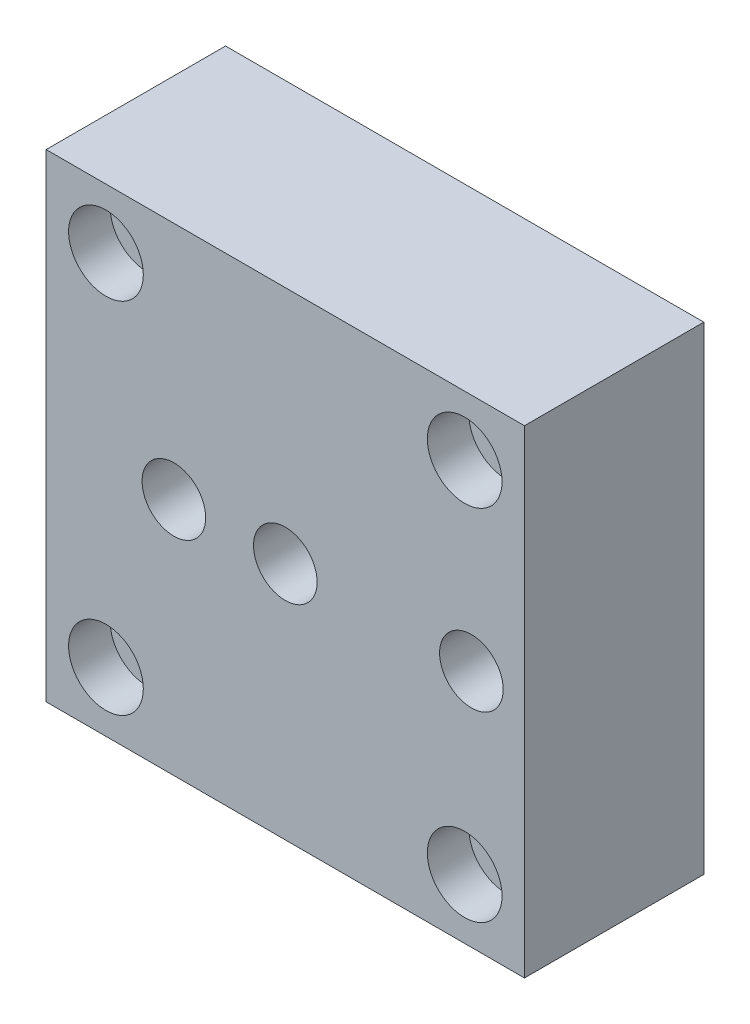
from build123d import *

# Parameters (mm, degrees)
SKETCH1_W                                           = 50.8
SKETCH1_H                                           = 50.8
BOSS_EXTRUDE1_DEPTH                                 = 19.05
CBORE_FOR_8_BINDING_HEAD_MACHINE_SCREW1_D           = 4.3053
CBORE_FOR_8_BINDING_HEAD_MACHINE_SCREW1_CBORE_D     = 7.9375
CBORE_FOR_8_BINDING_HEAD_MACHINE_SCREW1_CBORE_DEPTH = 4.4196
SKETCH5_R                                           = 3.3782
CUT_EXTRUDE1_DEPTH                                  = 41.659838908
SKETCH6_R                                           = 3.3782
CUT_EXTRUDE2_DEPTH                                  = 41.659838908


with BuildPart() as part:
    # Sketch1 → Boss-Extrude1 (new body)
    with BuildSketch(Plane.XY):
        Rectangle(SKETCH1_W, SKETCH1_H)
    extrude(amount=BOSS_EXTRUDE1_DEPTH)

    # CBORE for _8 Binding Head Machine Screw1 (through all)
    with Locations(Plane.XY.offset(19.05)):
        with Locations((-19.05, 19.05), (19.05, 19.05), (-19.05, -19.05), (19.05, -19.05)):
            CounterBoreHole(CBORE_FOR_8_BINDING_HEAD_MACHINE_SCREW1_D / 2, CBORE_FOR_8_BINDING_HEAD_MACHINE_SCREW1_CBORE_D / 2, CBORE_FOR_8_BINDING_HEAD_MACHINE_SCREW1_CBORE_DEPTH)

    # Sketch5 → Cut-Extrude1 (cut, through all)
    with BuildSketch(Plane.XY.offset(19.05)):
        Circle(SKETCH5_R)
    extrude(amount=-CUT_EXTRUDE1_DEPTH, mode=Mode.SUBTRACT)

    # Sketch6 → Cut-Extrude2 (cut, through all)
    with BuildSketch(Plane.XY.offset(19.05)):
        with Locations((19.7612, 0)):
            Circle(SKETCH6_R)
        with Locations((-11.8364, 0)):
            Circle(SKETCH6_R)
    extrude(amount=-CUT_EXTRUDE2_DEPTH, mode=Mode.SUBTRACT)


solid = part.part
